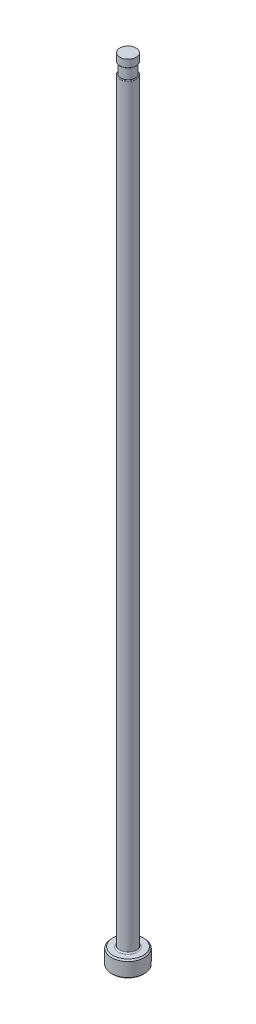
from build123d import *

# Parameters (mm, degrees)
CHAMFER1_SIZE     = 0.254
FILLET1_R         = 0.254
SKETCH2_W         = 0.2032
SKETCH2_H         = 2.032
D_SLOT_DEPTH      = 153.466131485
D_SLOT_DEPTH_BACK = 153.466131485
SKETCH5_W         = 0.0254
SKETCH5_H         = 1.524
FILLET2_R         = 0.127


with BuildPart() as part:
    # Sketch1 → Revolve1 (revolve)
    with BuildSketch(Plane.XY, mode=Mode.PRIVATE) as revolve1_sk:
        Polygon((0, 0), (-3.175, 0), (-3.175, 3.175), (-1.5875, 3.175), (-1.5875, 152.4), (0, 152.4), align=None)
    revolve(revolve1_sk.sketch.rotate(Axis((0, 259.958771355, 0), (0, -1, 0)), 270), axis=Axis((0, 259.958771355, 0), (0, -1, 0)))

    # Chamfer1
    chamfer1_edges = [part.edges().sort_by_distance(p)[0] for p in [
        (0, 3.175, -3.175),
        (0, 0, -3.175),
    ]]
    chamfer(chamfer1_edges, length=CHAMFER1_SIZE)

    # Fillet1
    fillet1_edges = [part.edges().sort_by_distance(p)[0] for p in [
        (0, 3.175, -1.5875),
    ]]
    fillet(fillet1_edges, radius=FILLET1_R)

    # Sketch2 → Vent Relief (revolve, cut)
    with BuildSketch(Plane.XY, mode=Mode.PRIVATE) as vent_relief_sk:
        with Locations((-1.4859, 149.86)):
            Rectangle(SKETCH2_W, SKETCH2_H)
    revolve(vent_relief_sk.sketch.rotate(Axis((0, 153.448281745, 0), (0, -1, 0)), 270), axis=Axis((0, 153.448281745, 0), (0, -1, 0)), mode=Mode.SUBTRACT)

    # Sketch3 → D-Slot (cut, two sides: drawn at the far end of the back side and taken through both)
    with BuildSketch(Plane.XY.offset(-D_SLOT_DEPTH_BACK)):
        with BuildLine():
            Line((-1.3843, 149.86), (-1.3843, 86.36))
            ThreePointArc((-1.3843, 86.36), (-1.435513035, 85.792038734), (-1.5875, 85.2424))
            Line((-1.5875, 85.2424), (-1.5875, 149.86))
            Line((-1.5875, 149.86), (-1.3843, 149.86))
        make_face()
    extrude(amount=D_SLOT_DEPTH + D_SLOT_DEPTH_BACK, mode=Mode.SUBTRACT)

    # Sketch5 → Vent Diameter (revolve, cut)
    with BuildSketch(Plane.XY, mode=Mode.PRIVATE) as vent_diameter_sk:
        with Locations((-1.5748, 151.638)):
            Rectangle(SKETCH5_W, SKETCH5_H)
    revolve(vent_diameter_sk.sketch.rotate(Axis((0, 152.687735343, 0), (0, -1, 0)), 90), axis=Axis((0, 152.687735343, 0), (0, -1, 0)), mode=Mode.SUBTRACT)

    # Fillet2
    fillet2_edges = [part.edges().sort_by_distance(p)[0] for p in [
        (1.369997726, 148.844, -0.802036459),
        (0, 150.876, 1.5621),
    ]]
    fillet(fillet2_edges, radius=FILLET2_R)


solid = part.part
